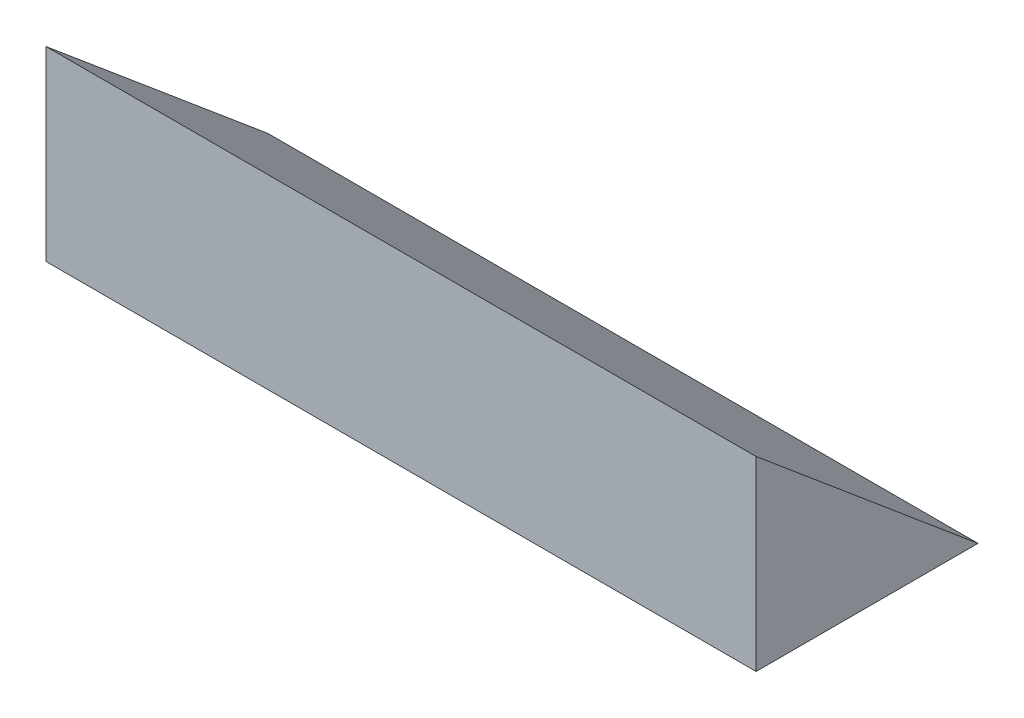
ISO-10303-21;
HEADER;
FILE_DESCRIPTION(('STEP AP214'),'2;1');
FILE_NAME('part.step','',(''),(''),'','','');
FILE_SCHEMA(('AUTOMOTIVE_DESIGN { 1 0 10303 214 1 1 1 1 }'));
ENDSEC;
DATA;
#1=APPLICATION_CONTEXT('core data for automotive mechanical design processes');
#2=APPLICATION_PROTOCOL_DEFINITION('international standard','automotive_design',2000,#1);
#3=PRODUCT_CONTEXT('',#1,'mechanical');
#4=PRODUCT('Part','Part','',(#3));
#5=PRODUCT_RELATED_PRODUCT_CATEGORY('part','',(#4));
#6=PRODUCT_DEFINITION_FORMATION('','',#4);
#7=PRODUCT_DEFINITION_CONTEXT('part definition',#1,'design');
#8=PRODUCT_DEFINITION('design','',#6,#7);
#9=PRODUCT_DEFINITION_SHAPE('','',#8);
#10=(LENGTH_UNIT() NAMED_UNIT(*) SI_UNIT(.MILLI.,.METRE.));
#11=(NAMED_UNIT(*) PLANE_ANGLE_UNIT() SI_UNIT($,.RADIAN.));
#12=(NAMED_UNIT(*) SI_UNIT($,.STERADIAN.) SOLID_ANGLE_UNIT());
#13=UNCERTAINTY_MEASURE_WITH_UNIT(LENGTH_MEASURE(1.E-05),#10,'distance_accuracy_value','');
#14=(GEOMETRIC_REPRESENTATION_CONTEXT(3) GLOBAL_UNCERTAINTY_ASSIGNED_CONTEXT((#13)) GLOBAL_UNIT_ASSIGNED_CONTEXT((#10,
#11,#12)) REPRESENTATION_CONTEXT('',''));
#15=CARTESIAN_POINT('',(0.,0.,0.));
#16=DIRECTION('',(0.,0.,1.));
#17=DIRECTION('',(1.,0.,0.));
#18=AXIS2_PLACEMENT_3D('',#15,#16,#17);
#19=CARTESIAN_POINT('',(1600.,0.,0.));
#20=DIRECTION('',(0.,0.,-1.));
#21=DIRECTION('',(-1.,0.,0.));
#22=AXIS2_PLACEMENT_3D('',#19,#20,#21);
#23=PLANE('',#22);
#24=DIRECTION('',(0.,-1.,0.));
#25=VECTOR('',#24,1.);
#26=CARTESIAN_POINT('',(0.,0.,0.));
#27=LINE('',#26,#25);
#28=CARTESIAN_POINT('',(0.,419.549815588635,0.));
#29=VERTEX_POINT('',#28);
#30=CARTESIAN_POINT('',(0.,0.,0.));
#31=VERTEX_POINT('',#30);
#32=EDGE_CURVE('E80',#29,#31,#27,.T.);
#33=ORIENTED_EDGE('',*,*,#32,.T.);
#34=DIRECTION('',(-1.,0.,0.));
#35=VECTOR('',#34,1.);
#36=CARTESIAN_POINT('',(1600.,0.,0.));
#37=LINE('',#36,#35);
#38=CARTESIAN_POINT('',(1600.,0.,0.));
#39=VERTEX_POINT('',#38);
#40=EDGE_CURVE('E11',#39,#31,#37,.T.);
#41=ORIENTED_EDGE('',*,*,#40,.F.);
#42=DIRECTION('',(0.,-1.,0.));
#43=VECTOR('',#42,1.);
#44=CARTESIAN_POINT('',(1600.,0.,0.));
#45=LINE('',#44,#43);
#46=CARTESIAN_POINT('',(1600.,419.549815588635,0.));
#47=VERTEX_POINT('',#46);
#48=EDGE_CURVE('E73',#47,#39,#45,.T.);
#49=ORIENTED_EDGE('',*,*,#48,.F.);
#50=DIRECTION('',(-1.,0.,0.));
#51=VECTOR('',#50,1.);
#52=CARTESIAN_POINT('',(1600.,419.549815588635,0.));
#53=LINE('',#52,#51);
#54=EDGE_CURVE('E81',#47,#29,#53,.T.);
#55=ORIENTED_EDGE('',*,*,#54,.T.);
#56=EDGE_LOOP('',(#33,#41,#49,#55));
#57=FACE_BOUND('',#56,.T.);
#58=ADVANCED_FACE('F33',(#57),#23,.F.);
#59=CARTESIAN_POINT('',(1600.,0.,0.));
#60=DIRECTION('',(0.,1.,0.));
#61=DIRECTION('',(0.,0.,1.));
#62=AXIS2_PLACEMENT_3D('',#59,#60,#61);
#63=PLANE('',#62);
#64=CARTESIAN_POINT('',(1050.,0.,-250.));
#65=DIRECTION('',(0.,-1.,0.));
#66=DIRECTION('',(0.,0.,1.));
#67=AXIS2_PLACEMENT_3D('',#64,#65,#66);
#68=CIRCLE('',#67,5.00000000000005);
#69=CARTESIAN_POINT('',(1050.,0.,-245.));
#70=VERTEX_POINT('',#69);
#71=EDGE_CURVE('E117',#70,#70,#68,.T.);
#72=ORIENTED_EDGE('',*,*,#71,.F.);
#73=EDGE_LOOP('',(#72));
#74=FACE_BOUND('',#73,.T.);
#75=CARTESIAN_POINT('',(550.,0.,-250.));
#76=DIRECTION('',(0.,-1.,0.));
#77=DIRECTION('',(0.,0.,-1.));
#78=AXIS2_PLACEMENT_3D('',#75,#76,#77);
#79=CIRCLE('',#78,5.00000000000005);
#80=CARTESIAN_POINT('',(550.,0.,-255.));
#81=VERTEX_POINT('',#80);
#82=EDGE_CURVE('E87',#81,#81,#79,.T.);
#83=ORIENTED_EDGE('',*,*,#82,.F.);
#84=EDGE_LOOP('',(#83));
#85=FACE_BOUND('',#84,.T.);
#86=DIRECTION('',(0.,0.,-1.));
#87=VECTOR('',#86,1.);
#88=CARTESIAN_POINT('',(0.,0.,0.));
#89=LINE('',#88,#87);
#90=CARTESIAN_POINT('',(0.,0.,-500.));
#91=VERTEX_POINT('',#90);
#92=EDGE_CURVE('E61',#31,#91,#89,.T.);
#93=ORIENTED_EDGE('',*,*,#92,.T.);
#94=DIRECTION('',(-1.,0.,0.));
#95=VECTOR('',#94,1.);
#96=CARTESIAN_POINT('',(1600.,0.,-500.));
#97=LINE('',#96,#95);
#98=CARTESIAN_POINT('',(1600.,0.,-500.));
#99=VERTEX_POINT('',#98);
#100=EDGE_CURVE('E41',#99,#91,#97,.T.);
#101=ORIENTED_EDGE('',*,*,#100,.F.);
#102=DIRECTION('',(0.,0.,-1.));
#103=VECTOR('',#102,1.);
#104=CARTESIAN_POINT('',(1600.,0.,0.));
#105=LINE('',#104,#103);
#106=EDGE_CURVE('E69',#39,#99,#105,.T.);
#107=ORIENTED_EDGE('',*,*,#106,.F.);
#108=ORIENTED_EDGE('',*,*,#40,.T.);
#109=EDGE_LOOP('',(#93,#101,#107,#108));
#110=FACE_BOUND('',#109,.T.);
#111=ADVANCED_FACE('F70',(#74,#85,#110),#63,.F.);
#112=CARTESIAN_POINT('',(1600.,0.,-500.));
#113=DIRECTION('',(0.,-0.766044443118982,0.642787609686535));
#114=DIRECTION('',(0.,-0.642787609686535,-0.766044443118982));
#115=AXIS2_PLACEMENT_3D('',#112,#113,#114);
#116=PLANE('',#115);
#117=DIRECTION('',(0.,0.642787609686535,0.766044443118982));
#118=VECTOR('',#117,1.);
#119=CARTESIAN_POINT('',(0.,0.,-500.));
#120=LINE('',#119,#118);
#121=EDGE_CURVE('E66',#91,#29,#120,.T.);
#122=ORIENTED_EDGE('',*,*,#121,.T.);
#123=ORIENTED_EDGE('',*,*,#54,.F.);
#124=DIRECTION('',(0.,0.642787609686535,0.766044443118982));
#125=VECTOR('',#124,1.);
#126=CARTESIAN_POINT('',(1600.,0.,-500.));
#127=LINE('',#126,#125);
#128=EDGE_CURVE('E49',#99,#47,#127,.T.);
#129=ORIENTED_EDGE('',*,*,#128,.F.);
#130=ORIENTED_EDGE('',*,*,#100,.T.);
#131=EDGE_LOOP('',(#122,#123,#129,#130));
#132=FACE_BOUND('',#131,.T.);
#133=ADVANCED_FACE('F92',(#132),#116,.F.);
#134=CARTESIAN_POINT('',(1600.,0.,0.));
#135=DIRECTION('',(-1.,0.,0.));
#136=DIRECTION('',(0.,0.,1.));
#137=AXIS2_PLACEMENT_3D('',#134,#135,#136);
#138=PLANE('',#137);
#139=ORIENTED_EDGE('',*,*,#48,.T.);
#140=ORIENTED_EDGE('',*,*,#106,.T.);
#141=ORIENTED_EDGE('',*,*,#128,.T.);
#142=EDGE_LOOP('',(#139,#140,#141));
#143=FACE_BOUND('',#142,.T.);
#144=ADVANCED_FACE('F76',(#143),#138,.F.);
#145=CARTESIAN_POINT('',(0.,0.,0.));
#146=DIRECTION('',(-1.,0.,0.));
#147=DIRECTION('',(0.,0.,1.));
#148=AXIS2_PLACEMENT_3D('',#145,#146,#147);
#149=PLANE('',#148);
#150=ORIENTED_EDGE('',*,*,#32,.F.);
#151=ORIENTED_EDGE('',*,*,#121,.F.);
#152=ORIENTED_EDGE('',*,*,#92,.F.);
#153=EDGE_LOOP('',(#150,#151,#152));
#154=FACE_BOUND('',#153,.T.);
#155=ADVANCED_FACE('F93',(#154),#149,.T.);
#156=CARTESIAN_POINT('',(550.,10.,-250.));
#157=DIRECTION('',(0.,-1.,0.));
#158=DIRECTION('',(0.,0.,-1.));
#159=AXIS2_PLACEMENT_3D('',#156,#157,#158);
#160=CYLINDRICAL_SURFACE('',#159,5.00000000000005);
#161=CARTESIAN_POINT('',(550.,10.,-250.));
#162=DIRECTION('',(0.,-1.,0.));
#163=DIRECTION('',(0.,0.,-1.));
#164=AXIS2_PLACEMENT_3D('',#161,#162,#163);
#165=CIRCLE('',#164,5.00000000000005);
#166=CARTESIAN_POINT('',(550.,10.,-255.));
#167=VERTEX_POINT('',#166);
#168=EDGE_CURVE('E83',#167,#167,#165,.T.);
#169=ORIENTED_EDGE('',*,*,#168,.F.);
#170=EDGE_LOOP('',(#169));
#171=FACE_BOUND('',#170,.T.);
#172=ORIENTED_EDGE('',*,*,#82,.T.);
#173=EDGE_LOOP('',(#172));
#174=FACE_BOUND('',#173,.T.);
#175=ADVANCED_FACE('F95',(#171,#174),#160,.F.);
#176=CARTESIAN_POINT('',(550.,10.,-250.));
#177=DIRECTION('',(0.,-1.,0.));
#178=DIRECTION('',(0.,0.,-1.));
#179=AXIS2_PLACEMENT_3D('',#176,#177,#178);
#180=PLANE('',#179);
#181=ORIENTED_EDGE('',*,*,#168,.T.);
#182=EDGE_LOOP('',(#181));
#183=FACE_BOUND('',#182,.T.);
#184=ADVANCED_FACE('F101',(#183),#180,.T.);
#185=CARTESIAN_POINT('',(1050.,10.,-250.));
#186=DIRECTION('',(0.,-1.,0.));
#187=DIRECTION('',(0.,0.,-1.));
#188=AXIS2_PLACEMENT_3D('',#185,#186,#187);
#189=CYLINDRICAL_SURFACE('',#188,5.00000000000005);
#190=CARTESIAN_POINT('',(1050.,10.,-250.));
#191=DIRECTION('',(0.,-1.,0.));
#192=DIRECTION('',(0.,0.,1.));
#193=AXIS2_PLACEMENT_3D('',#190,#191,#192);
#194=CIRCLE('',#193,5.00000000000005);
#195=CARTESIAN_POINT('',(1050.,10.,-245.));
#196=VERTEX_POINT('',#195);
#197=EDGE_CURVE('E121',#196,#196,#194,.T.);
#198=ORIENTED_EDGE('',*,*,#197,.F.);
#199=EDGE_LOOP('',(#198));
#200=FACE_BOUND('',#199,.T.);
#201=ORIENTED_EDGE('',*,*,#71,.T.);
#202=EDGE_LOOP('',(#201));
#203=FACE_BOUND('',#202,.T.);
#204=ADVANCED_FACE('F127',(#200,#203),#189,.F.);
#205=CARTESIAN_POINT('',(1050.,10.,-250.));
#206=DIRECTION('',(0.,1.,0.));
#207=DIRECTION('',(0.,0.,1.));
#208=AXIS2_PLACEMENT_3D('',#205,#206,#207);
#209=PLANE('',#208);
#210=ORIENTED_EDGE('',*,*,#197,.T.);
#211=EDGE_LOOP('',(#210));
#212=FACE_BOUND('',#211,.T.);
#213=ADVANCED_FACE('F129',(#212),#209,.F.);
#214=CLOSED_SHELL('',(#58,#111,#133,#144,#155,#175,#184,#204,#213));
#215=MANIFOLD_SOLID_BREP('B2',#214);
#216=ADVANCED_BREP_SHAPE_REPRESENTATION('',(#18,#215),#14);
#217=SHAPE_DEFINITION_REPRESENTATION(#9,#216);
ENDSEC;
END-ISO-10303-21;
